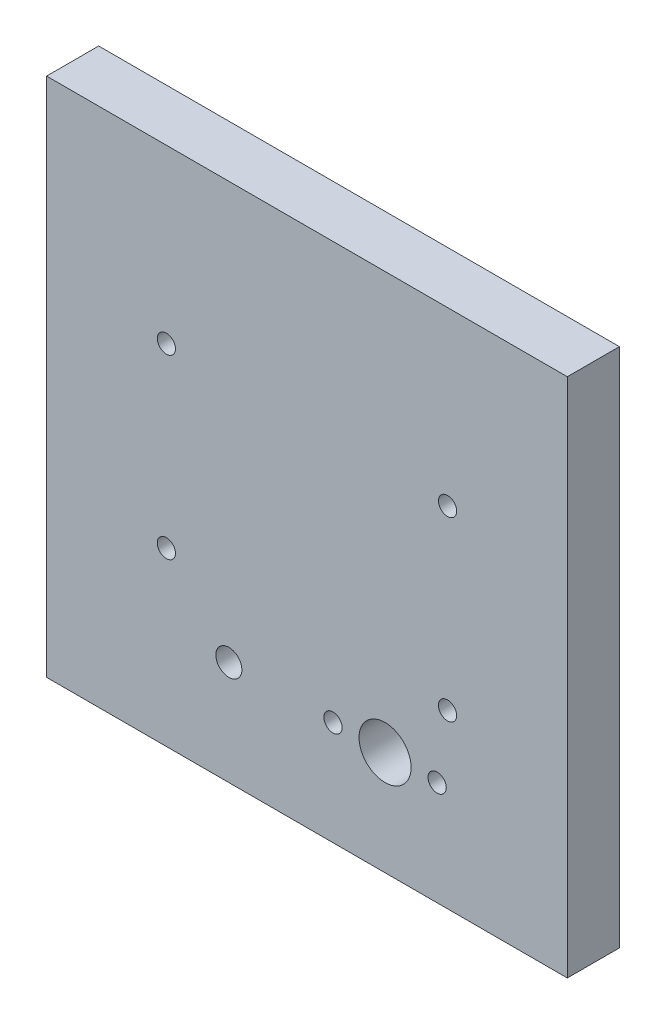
from build123d import *

# Parameters (mm, degrees)
SKETCH_1_W          = 100
SKETCH_1_H          = 100
EXTRUDE_1_DEPTH     = 10
SKETCH_2_R          = 1.75
CUT_EXTRUDE_1_DEPTH = 8
SKETCH_3_R          = 2.5
SKETCH_3_R_2        = 5
SKETCH_3_R_3        = 1.75
CUT_EXTRUDE_2_DEPTH = 10


with BuildPart() as part:
    # Sketch 1 → Extrude 1 (new body)
    with BuildSketch(Plane.XY):
        with Locations((50, 50)):
            Rectangle(SKETCH_1_W, SKETCH_1_H)
    extrude(amount=EXTRUDE_1_DEPTH)

    # Sketch 2 → Cut-Extrude 1 (cut)
    with BuildSketch(Plane.XY.offset(10)):
        with Locations((23, 67)):
            Circle(SKETCH_2_R)
        with Locations((77, 67)):
            Circle(SKETCH_2_R)
        with Locations((23, 33)):
            Circle(SKETCH_2_R)
        with Locations((77, 33)):
            Circle(SKETCH_2_R)
    extrude(amount=-CUT_EXTRUDE_1_DEPTH, mode=Mode.SUBTRACT)

    # Sketch 3 → Cut-Extrude 2 (cut)
    with BuildSketch(Plane.XY.offset(10)):
        with Locations((35, 20)):
            Circle(SKETCH_3_R)
        with Locations((65, 20)):
            Circle(SKETCH_3_R_2)
        with Locations((55, 20)):
            Circle(SKETCH_3_R_3)
        with Locations((75, 20)):
            Circle(SKETCH_3_R_3)
    extrude(amount=-CUT_EXTRUDE_2_DEPTH, mode=Mode.SUBTRACT)


solid = part.part
